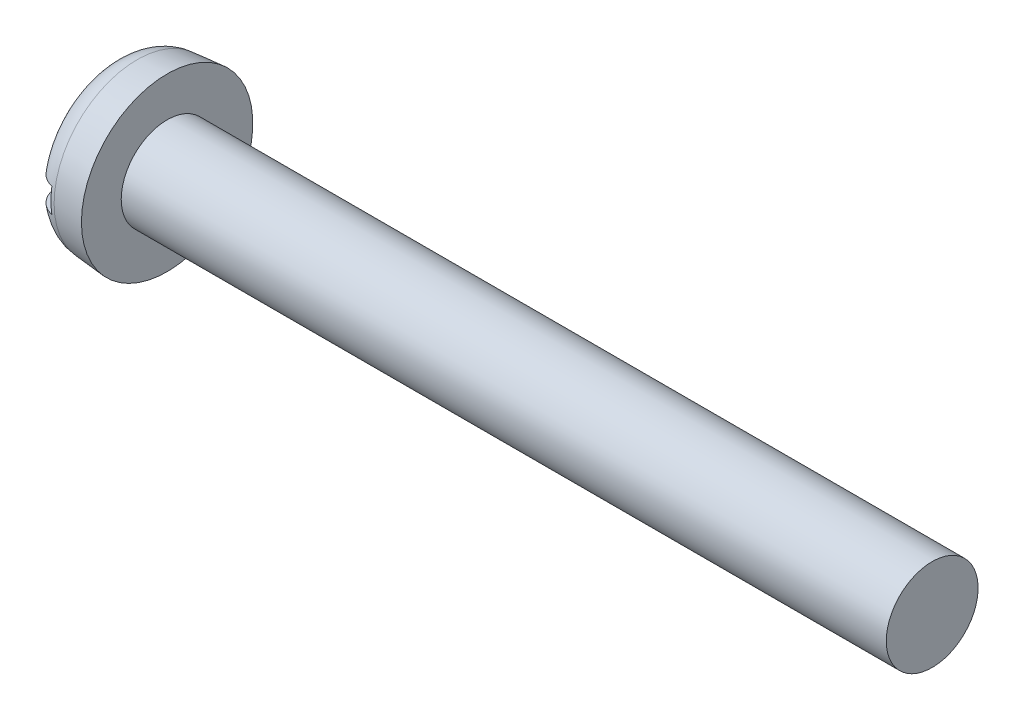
ISO-10303-21;
HEADER;
FILE_DESCRIPTION(('STEP AP214'),'2;1');
FILE_NAME('part.step','',(''),(''),'','','');
FILE_SCHEMA(('AUTOMOTIVE_DESIGN { 1 0 10303 214 1 1 1 1 }'));
ENDSEC;
DATA;
#1=APPLICATION_CONTEXT('core data for automotive mechanical design processes');
#2=APPLICATION_PROTOCOL_DEFINITION('international standard','automotive_design',2000,#1);
#3=PRODUCT_CONTEXT('',#1,'mechanical');
#4=PRODUCT('Part','Part','',(#3));
#5=PRODUCT_RELATED_PRODUCT_CATEGORY('part','',(#4));
#6=PRODUCT_DEFINITION_FORMATION('','',#4);
#7=PRODUCT_DEFINITION_CONTEXT('part definition',#1,'design');
#8=PRODUCT_DEFINITION('design','',#6,#7);
#9=PRODUCT_DEFINITION_SHAPE('','',#8);
#10=(LENGTH_UNIT() NAMED_UNIT(*) SI_UNIT(.MILLI.,.METRE.));
#11=(NAMED_UNIT(*) PLANE_ANGLE_UNIT() SI_UNIT($,.RADIAN.));
#12=(NAMED_UNIT(*) SI_UNIT($,.STERADIAN.) SOLID_ANGLE_UNIT());
#13=UNCERTAINTY_MEASURE_WITH_UNIT(LENGTH_MEASURE(1.E-05),#10,'distance_accuracy_value','');
#14=(GEOMETRIC_REPRESENTATION_CONTEXT(3) GLOBAL_UNCERTAINTY_ASSIGNED_CONTEXT((#13)) GLOBAL_UNIT_ASSIGNED_CONTEXT((#10,
#11,#12)) REPRESENTATION_CONTEXT('',''));
#15=CARTESIAN_POINT('',(0.,0.,0.));
#16=DIRECTION('',(0.,0.,1.));
#17=DIRECTION('',(1.,0.,0.));
#18=AXIS2_PLACEMENT_3D('',#15,#16,#17);
#19=CARTESIAN_POINT('',(0.,0.,0.));
#20=DIRECTION('',(-1.,0.,0.));
#21=DIRECTION('',(0.,0.,1.));
#22=AXIS2_PLACEMENT_3D('',#19,#20,#21);
#23=PLANE('',#22);
#24=DIRECTION('',(0.,0.,-1.));
#25=VECTOR('',#24,1.);
#26=CARTESIAN_POINT('',(0.,0.399999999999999,2.8));
#27=LINE('',#26,#25);
#28=CARTESIAN_POINT('',(0.,0.399999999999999,1.77326763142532));
#29=VERTEX_POINT('',#28);
#30=CARTESIAN_POINT('',(0.,0.399999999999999,-1.77326763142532));
#31=VERTEX_POINT('',#30);
#32=EDGE_CURVE('E89',#29,#31,#27,.T.);
#33=ORIENTED_EDGE('',*,*,#32,.F.);
#34=CARTESIAN_POINT('',(0.,0.,0.));
#35=DIRECTION('',(-1.,0.,0.));
#36=DIRECTION('',(0.,0.,1.));
#37=AXIS2_PLACEMENT_3D('',#34,#35,#36);
#38=CIRCLE('',#37,1.81782234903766);
#39=EDGE_CURVE('E95',#29,#31,#38,.T.);
#40=ORIENTED_EDGE('',*,*,#39,.T.);
#41=EDGE_LOOP('',(#33,#40));
#42=FACE_BOUND('',#41,.T.);
#43=ADVANCED_FACE('F36',(#42),#23,.T.);
#44=CARTESIAN_POINT('',(-25.4,0.,0.));
#45=DIRECTION('',(-1.,0.,0.));
#46=DIRECTION('',(0.,0.,1.));
#47=AXIS2_PLACEMENT_3D('',#44,#45,#46);
#48=CYLINDRICAL_SURFACE('',#47,1.5);
#49=CARTESIAN_POINT('',(26.8,0.,0.));
#50=DIRECTION('',(-1.,0.,0.));
#51=DIRECTION('',(0.,0.,1.));
#52=AXIS2_PLACEMENT_3D('',#49,#50,#51);
#53=CIRCLE('',#52,1.5);
#54=CARTESIAN_POINT('',(26.8,0.,1.5));
#55=VERTEX_POINT('',#54);
#56=EDGE_CURVE('E96',#55,#55,#53,.T.);
#57=ORIENTED_EDGE('',*,*,#56,.T.);
#58=EDGE_LOOP('',(#57));
#59=FACE_BOUND('',#58,.T.);
#60=CARTESIAN_POINT('',(1.8,0.,0.));
#61=DIRECTION('',(-1.,0.,0.));
#62=DIRECTION('',(0.,0.,1.));
#63=AXIS2_PLACEMENT_3D('',#60,#61,#62);
#64=CIRCLE('',#63,1.5);
#65=CARTESIAN_POINT('',(1.8,0.,1.5));
#66=VERTEX_POINT('',#65);
#67=EDGE_CURVE('E153',#66,#66,#64,.T.);
#68=ORIENTED_EDGE('',*,*,#67,.F.);
#69=EDGE_LOOP('',(#68));
#70=FACE_BOUND('',#69,.T.);
#71=ADVANCED_FACE('F141',(#59,#70),#48,.T.);
#72=CARTESIAN_POINT('',(26.8,1.5,0.));
#73=DIRECTION('',(1.,0.,0.));
#74=DIRECTION('',(0.,0.,-1.));
#75=AXIS2_PLACEMENT_3D('',#72,#73,#74);
#76=PLANE('',#75);
#77=ORIENTED_EDGE('',*,*,#56,.F.);
#78=EDGE_LOOP('',(#77));
#79=FACE_BOUND('',#78,.T.);
#80=ADVANCED_FACE('F139',(#79),#76,.T.);
#81=DIRECTION('',(0.,0.,1.));
#82=VECTOR('',#81,1.);
#83=CARTESIAN_POINT('',(0.,-0.4,-2.8));
#84=LINE('',#83,#82);
#85=CARTESIAN_POINT('',(0.,-0.4,-1.77326763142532));
#86=VERTEX_POINT('',#85);
#87=CARTESIAN_POINT('',(0.,-0.4,1.77326763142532));
#88=VERTEX_POINT('',#87);
#89=EDGE_CURVE('E80',#86,#88,#84,.T.);
#90=ORIENTED_EDGE('',*,*,#89,.F.);
#91=EDGE_CURVE('E87',#86,#88,#38,.T.);
#92=ORIENTED_EDGE('',*,*,#91,.T.);
#93=EDGE_LOOP('',(#90,#92));
#94=FACE_BOUND('',#93,.T.);
#95=ADVANCED_FACE('F86',(#94),#23,.T.);
#96=CARTESIAN_POINT('',(0.,0.,0.));
#97=DIRECTION('',(1.,0.,0.));
#98=DIRECTION('',(0.,0.,-1.));
#99=AXIS2_PLACEMENT_3D('',#96,#97,#98);
#100=CONICAL_SURFACE('',#99,2.64252040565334,0.087266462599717);
#101=CARTESIAN_POINT('',(0.821559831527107,0.,0.));
#102=DIRECTION('',(-1.,0.,0.));
#103=DIRECTION('',(0.,0.,1.));
#104=AXIS2_PLACEMENT_3D('',#101,#102,#103);
#105=CIRCLE('',#104,2.71439757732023);
#106=CARTESIAN_POINT('',(0.821559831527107,0.,2.71439757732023));
#107=VERTEX_POINT('',#106);
#108=EDGE_CURVE('E99',#107,#107,#105,.F.);
#109=ORIENTED_EDGE('',*,*,#108,.T.);
#110=EDGE_LOOP('',(#109));
#111=FACE_BOUND('',#110,.T.);
#112=CARTESIAN_POINT('',(1.8,0.,0.));
#113=DIRECTION('',(-1.,0.,0.));
#114=DIRECTION('',(0.,0.,1.));
#115=AXIS2_PLACEMENT_3D('',#112,#113,#114);
#116=CIRCLE('',#115,2.8);
#117=CARTESIAN_POINT('',(1.8,0.,2.8));
#118=VERTEX_POINT('',#117);
#119=EDGE_CURVE('E101',#118,#118,#116,.T.);
#120=ORIENTED_EDGE('',*,*,#119,.T.);
#121=EDGE_LOOP('',(#120));
#122=FACE_BOUND('',#121,.T.);
#123=ADVANCED_FACE('F132',(#111,#122),#100,.T.);
#124=CARTESIAN_POINT('',(1.8,1.5,0.));
#125=DIRECTION('',(-1.,0.,0.));
#126=DIRECTION('',(0.,0.,1.));
#127=AXIS2_PLACEMENT_3D('',#124,#125,#126);
#128=PLANE('',#127);
#129=ORIENTED_EDGE('',*,*,#119,.F.);
#130=EDGE_LOOP('',(#129));
#131=FACE_BOUND('',#130,.T.);
#132=ORIENTED_EDGE('',*,*,#67,.T.);
#133=EDGE_LOOP('',(#132));
#134=FACE_BOUND('',#133,.T.);
#135=ADVANCED_FACE('F128',(#131,#134),#128,.F.);
#136=CARTESIAN_POINT('',(0.9,0.,0.));
#137=DIRECTION('',(-1.,0.,0.));
#138=DIRECTION('',(0.,0.,1.));
#139=AXIS2_PLACEMENT_3D('',#136,#137,#138);
#140=TOROIDAL_SURFACE('',#139,1.81782234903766,0.9);
#141=CARTESIAN_POINT('',(0.285780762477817,0.399999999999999,-2.44311963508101));
#142=CARTESIAN_POINT('',(0.322325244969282,0.399999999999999,-2.47769297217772));
#143=CARTESIAN_POINT('',(0.361794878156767,0.399999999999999,-2.50922544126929));
#144=CARTESIAN_POINT('',(0.445493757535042,0.399999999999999,-2.56525291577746));
#145=CARTESIAN_POINT('',(0.48972822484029,0.399999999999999,-2.58974009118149));
#146=CARTESIAN_POINT('',(0.581685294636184,0.399999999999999,-2.63091846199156));
#147=CARTESIAN_POINT('',(0.629407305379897,0.399999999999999,-2.64761097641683));
#148=CARTESIAN_POINT('',(0.726972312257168,0.399999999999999,-2.67270033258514));
#149=CARTESIAN_POINT('',(0.776814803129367,0.399999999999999,-2.68109913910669));
#150=CARTESIAN_POINT('',(0.876977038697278,0.399999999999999,-2.68933922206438));
#151=CARTESIAN_POINT('',(0.92729364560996,0.399999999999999,-2.68921866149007));
#152=CARTESIAN_POINT('',(1.02719093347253,0.399999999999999,-2.68051830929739));
#153=CARTESIAN_POINT('',(1.07677160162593,0.399999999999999,-2.67193837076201));
#154=CARTESIAN_POINT('',(1.17371760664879,0.399999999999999,-2.6465919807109));
#155=CARTESIAN_POINT('',(1.2210859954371,0.399999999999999,-2.62983719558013));
#156=CARTESIAN_POINT('',(1.31235127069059,0.399999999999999,-2.58864040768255));
#157=CARTESIAN_POINT('',(1.35624813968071,0.399999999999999,-2.56419836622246));
#158=CARTESIAN_POINT('',(1.43950339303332,0.399999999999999,-2.50824069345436));
#159=CARTESIAN_POINT('',(1.47884484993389,0.399999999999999,-2.47669988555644));
#160=CARTESIAN_POINT('',(1.55173067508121,0.399999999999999,-2.40751412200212));
#161=CARTESIAN_POINT('',(1.5852748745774,0.399999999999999,-2.36986898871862));
#162=CARTESIAN_POINT('',(1.64594872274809,0.399999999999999,-2.28919528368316));
#163=CARTESIAN_POINT('',(1.67301846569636,0.399999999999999,-2.24612167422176));
#164=CARTESIAN_POINT('',(1.71966197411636,0.399999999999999,-2.15609376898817));
#165=CARTESIAN_POINT('',(1.73923530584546,0.399999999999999,-2.10913924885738));
#166=CARTESIAN_POINT('',(1.77066025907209,0.399999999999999,-2.01194193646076));
#167=CARTESIAN_POINT('',(1.78239254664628,0.399999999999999,-1.96166058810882));
#168=CARTESIAN_POINT('',(1.7974373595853,0.399999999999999,-1.85985639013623));
#169=CARTESIAN_POINT('',(1.80074908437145,0.399999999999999,-1.80833342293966));
#170=CARTESIAN_POINT('',(1.79894832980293,0.399999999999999,-1.70434405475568));
#171=CARTESIAN_POINT('',(1.79365584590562,0.399999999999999,-1.651880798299));
#172=CARTESIAN_POINT('',(1.77456092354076,0.399999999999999,-1.54852841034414));
#173=CARTESIAN_POINT('',(1.76075741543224,0.399999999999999,-1.49763947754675));
#174=CARTESIAN_POINT('',(1.7246504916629,0.399999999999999,-1.3975266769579));
#175=CARTESIAN_POINT('',(1.70214283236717,0.399999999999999,-1.34837644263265));
#176=CARTESIAN_POINT('',(1.64933120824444,0.399999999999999,-1.25444995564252));
#177=CARTESIAN_POINT('',(1.6190255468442,0.399999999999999,-1.20967465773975));
#178=CARTESIAN_POINT('',(1.55085214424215,0.399999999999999,-1.12504927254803));
#179=CARTESIAN_POINT('',(1.51286662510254,0.399999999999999,-1.08529386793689));
#180=CARTESIAN_POINT('',(1.4306134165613,0.399999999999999,-1.01288372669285));
#181=CARTESIAN_POINT('',(1.38634513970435,0.399999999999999,-0.980229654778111));
#182=CARTESIAN_POINT('',(1.29378824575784,0.399999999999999,-0.924048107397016));
#183=CARTESIAN_POINT('',(1.24562231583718,0.399999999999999,-0.900319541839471));
#184=CARTESIAN_POINT('',(1.14574424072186,0.399999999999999,-0.862177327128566));
#185=CARTESIAN_POINT('',(1.09403573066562,0.399999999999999,-0.847754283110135));
#186=CARTESIAN_POINT('',(0.993395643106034,0.399999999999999,-0.830011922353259));
#187=CARTESIAN_POINT('',(0.944615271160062,0.399999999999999,-0.825833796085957));
#188=CARTESIAN_POINT('',(0.847107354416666,0.399999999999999,-0.826334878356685));
#189=CARTESIAN_POINT('',(0.798379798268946,0.399999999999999,-0.831011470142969));
#190=CARTESIAN_POINT('',(0.705495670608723,0.399999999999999,-0.848340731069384));
#191=CARTESIAN_POINT('',(0.661242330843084,0.399999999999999,-0.860484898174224));
#192=CARTESIAN_POINT('',(0.575232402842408,0.399999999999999,-0.891650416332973));
#193=CARTESIAN_POINT('',(0.53347652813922,0.399999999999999,-0.910673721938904));
#194=CARTESIAN_POINT('',(0.451191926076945,0.399999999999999,-0.956010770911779));
#195=CARTESIAN_POINT('',(0.410848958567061,0.399999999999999,-0.982660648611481));
#196=CARTESIAN_POINT('',(0.334722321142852,0.399999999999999,-1.04182188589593));
#197=CARTESIAN_POINT('',(0.298940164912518,0.399999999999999,-1.0743351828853));
#198=CARTESIAN_POINT('',(0.229649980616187,0.399999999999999,-1.14749226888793));
#199=CARTESIAN_POINT('',(0.19663491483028,0.399999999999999,-1.18860403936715));
#200=CARTESIAN_POINT('',(0.137645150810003,0.399999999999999,-1.27560624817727));
#201=CARTESIAN_POINT('',(0.111672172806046,0.399999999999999,-1.32149785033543));
#202=CARTESIAN_POINT('',(0.0665593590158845,0.399999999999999,-1.41881690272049));
#203=CARTESIAN_POINT('',(0.0477401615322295,0.399999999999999,-1.47039354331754));
#204=CARTESIAN_POINT('',(0.0191028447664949,0.399999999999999,-1.57598967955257));
#205=CARTESIAN_POINT('',(0.0092842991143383,0.399999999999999,-1.63000905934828));
#206=CARTESIAN_POINT('',(-0.000908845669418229,0.399999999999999,-1.73850050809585));
#207=CARTESIAN_POINT('',(-0.00135843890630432,0.399999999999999,-1.7929654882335));
#208=CARTESIAN_POINT('',(0.00713794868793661,0.399999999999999,-1.90117587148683));
#209=CARTESIAN_POINT('',(0.0160852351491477,0.399999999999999,-1.9549211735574));
#210=CARTESIAN_POINT('',(0.0428869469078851,0.399999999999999,-2.05874477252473));
#211=CARTESIAN_POINT('',(0.0605196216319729,0.399999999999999,-2.10888044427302));
#212=CARTESIAN_POINT('',(0.104140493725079,0.399999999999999,-2.20532358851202));
#213=CARTESIAN_POINT('',(0.130117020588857,0.399999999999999,-2.25163629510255));
#214=CARTESIAN_POINT('',(0.178150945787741,0.399999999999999,-2.32211375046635));
#215=CARTESIAN_POINT('',(0.197843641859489,0.399999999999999,-2.34792122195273));
#216=CARTESIAN_POINT('',(0.239879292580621,0.399999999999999,-2.39728022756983));
#217=CARTESIAN_POINT('',(0.26222221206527,0.399999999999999,-2.42083179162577));
#218=CARTESIAN_POINT('',(0.285780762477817,0.399999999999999,-2.44311963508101));
#219=B_SPLINE_CURVE_WITH_KNOTS('',3,(#141,#142,#143,#144,#145,#146,#147,#148,#149,#150,#151,
#152,#153,#154,#155,#156,#157,#158,#159,#160,#161,#162,#163,#164,#165,#166,#167,#168,#169,#170,
#171,#172,#173,#174,#175,#176,#177,#178,#179,#180,#181,#182,#183,#184,#185,#186,#187,#188,#189,
#190,#191,#192,#193,#194,#195,#196,#197,#198,#199,#200,#201,#202,#203,#204,#205,#206,#207,#208,
#209,#210,#211,#212,#213,#214,#215,#216,#217,#218),.UNSPECIFIED.,.T.,.F.,(4,2,2,2,2,2,2,2,2,2,2,
2,2,2,2,2,2,2,2,2,2,2,2,2,2,2,2,2,2,2,2,2,2,2,2,2,2,2,4),(0.,0.15080428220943,0.301775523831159,
0.452721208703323,0.603631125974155,0.753865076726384,0.904101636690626,1.05412441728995,
1.2041479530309,1.35471219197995,1.50528081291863,1.65719291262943,1.80911380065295,
1.96329712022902,2.11749509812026,2.27496068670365,2.43244606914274,2.59387611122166,
2.75534130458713,2.9195015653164,3.08367718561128,3.24389389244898,3.40394859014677,
3.55004213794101,3.69609251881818,3.83315592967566,3.97025831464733,4.11470991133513,
4.25920932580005,4.41668805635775,4.57420522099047,4.73812462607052,4.90203626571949,
5.06463536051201,5.22725705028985,5.38592661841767,5.54437521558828,5.64159310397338,
5.73880970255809),.UNSPECIFIED.);
#220=CARTESIAN_POINT('',(0.7,0.399999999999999,-2.66547244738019));
#221=VERTEX_POINT('',#220);
#222=EDGE_CURVE('E11',#31,#221,#219,.T.);
#223=ORIENTED_EDGE('',*,*,#222,.F.);
#224=ORIENTED_EDGE('',*,*,#39,.F.);
#225=CARTESIAN_POINT('',(0.356169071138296,0.399999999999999,1.02545886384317));
#226=CARTESIAN_POINT('',(0.394477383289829,0.399999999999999,0.994276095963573));
#227=CARTESIAN_POINT('',(0.435252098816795,0.399999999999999,0.966090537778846));
#228=CARTESIAN_POINT('',(0.520874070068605,0.399999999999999,0.916713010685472));
#229=CARTESIAN_POINT('',(0.56572297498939,0.399999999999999,0.895523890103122));
#230=CARTESIAN_POINT('',(0.658585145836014,0.399999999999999,0.861072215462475));
#231=CARTESIAN_POINT('',(0.706609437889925,0.399999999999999,0.84783908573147));
#232=CARTESIAN_POINT('',(0.80424325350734,0.399999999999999,0.83024223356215));
#233=CARTESIAN_POINT('',(0.853851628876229,0.399999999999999,0.825872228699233));
#234=CARTESIAN_POINT('',(0.950010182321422,0.399999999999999,0.826277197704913));
#235=CARTESIAN_POINT('',(0.99656347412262,0.399999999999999,0.830513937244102));
#236=CARTESIAN_POINT('',(1.08828168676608,0.399999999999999,0.846797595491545));
#237=CARTESIAN_POINT('',(1.1334463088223,0.399999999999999,0.858846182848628));
#238=CARTESIAN_POINT('',(1.22099947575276,0.399999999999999,0.890027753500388));
#239=CARTESIAN_POINT('',(1.26339999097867,0.399999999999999,0.909127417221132));
#240=CARTESIAN_POINT('',(1.34475562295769,0.399999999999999,0.953613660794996));
#241=CARTESIAN_POINT('',(1.38370973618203,0.399999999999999,0.979002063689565));
#242=CARTESIAN_POINT('',(1.4606297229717,0.399999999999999,1.03768873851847));
#243=CARTESIAN_POINT('',(1.49821861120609,0.399999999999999,1.07148126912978));
#244=CARTESIAN_POINT('',(1.56766557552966,0.399999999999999,1.14451739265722));
#245=CARTESIAN_POINT('',(1.59952174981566,0.399999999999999,1.18376278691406));
#246=CARTESIAN_POINT('',(1.65882951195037,0.399999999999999,1.26965174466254));
#247=CARTESIAN_POINT('',(1.68580874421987,0.399999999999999,1.3166225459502));
#248=CARTESIAN_POINT('',(1.7316261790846,0.399999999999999,1.41438438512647));
#249=CARTESIAN_POINT('',(1.7504634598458,0.399999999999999,1.46517585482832));
#250=CARTESIAN_POINT('',(1.77959171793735,0.399999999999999,1.56990546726));
#251=CARTESIAN_POINT('',(1.78976336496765,0.399999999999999,1.62387693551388));
#252=CARTESIAN_POINT('',(1.80070617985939,0.399999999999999,1.73276786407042));
#253=CARTESIAN_POINT('',(1.80147810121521,0.399999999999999,1.78768724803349));
#254=CARTESIAN_POINT('',(1.7935515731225,0.399999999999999,1.89576039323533));
#255=CARTESIAN_POINT('',(1.78503812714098,0.399999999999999,1.94892767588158));
#256=CARTESIAN_POINT('',(1.75897009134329,0.399999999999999,2.05299963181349));
#257=CARTESIAN_POINT('',(1.74141670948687,0.399999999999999,2.10390460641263));
#258=CARTESIAN_POINT('',(1.69825810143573,0.399999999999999,2.20064023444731));
#259=CARTESIAN_POINT('',(1.67286703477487,0.399999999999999,2.24656646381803));
#260=CARTESIAN_POINT('',(1.61458416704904,0.399999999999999,2.33338474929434));
#261=CARTESIAN_POINT('',(1.58169323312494,0.399999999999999,2.37427738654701));
#262=CARTESIAN_POINT('',(1.51007060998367,0.399999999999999,2.44900649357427));
#263=CARTESIAN_POINT('',(1.47146964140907,0.399999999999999,2.48296829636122));
#264=CARTESIAN_POINT('',(1.38904817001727,0.399999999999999,2.54382334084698));
#265=CARTESIAN_POINT('',(1.34522808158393,0.399999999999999,2.57071714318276));
#266=CARTESIAN_POINT('',(1.25424836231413,0.399999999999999,2.61630908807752));
#267=CARTESIAN_POINT('',(1.20714119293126,0.399999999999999,2.63511196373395));
#268=CARTESIAN_POINT('',(1.11042474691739,0.399999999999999,2.66447616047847));
#269=CARTESIAN_POINT('',(1.06081558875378,0.399999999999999,2.67503787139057));
#270=CARTESIAN_POINT('',(0.960893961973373,0.399999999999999,2.68755622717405));
#271=CARTESIAN_POINT('',(0.910589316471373,0.399999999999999,2.68957539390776));
#272=CARTESIAN_POINT('',(0.810358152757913,0.399999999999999,2.68512046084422));
#273=CARTESIAN_POINT('',(0.760431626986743,0.399999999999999,2.67864653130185));
#274=CARTESIAN_POINT('',(0.662478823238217,0.399999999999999,2.65741995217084));
#275=CARTESIAN_POINT('',(0.614448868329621,0.399999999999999,2.64268425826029));
#276=CARTESIAN_POINT('',(0.521534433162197,0.399999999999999,2.60538142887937));
#277=CARTESIAN_POINT('',(0.476649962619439,0.399999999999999,2.58281426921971));
#278=CARTESIAN_POINT('',(0.391148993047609,0.399999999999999,2.53043182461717));
#279=CARTESIAN_POINT('',(0.350545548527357,0.399999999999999,2.50059523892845));
#280=CARTESIAN_POINT('',(0.274874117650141,0.399999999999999,2.43457977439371));
#281=CARTESIAN_POINT('',(0.239806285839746,0.399999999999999,2.39840071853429));
#282=CARTESIAN_POINT('',(0.1758792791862,0.399999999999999,2.32042102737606));
#283=CARTESIAN_POINT('',(0.147073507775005,0.399999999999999,2.27857662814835));
#284=CARTESIAN_POINT('',(0.0967847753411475,0.399999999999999,2.19069995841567));
#285=CARTESIAN_POINT('',(0.07530224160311,0.399999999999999,2.14466744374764));
#286=CARTESIAN_POINT('',(0.0399276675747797,0.399999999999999,2.04903409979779));
#287=CARTESIAN_POINT('',(0.0261471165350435,0.399999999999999,1.99939205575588));
#288=CARTESIAN_POINT('',(0.00693602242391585,0.399999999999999,1.89852251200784));
#289=CARTESIAN_POINT('',(0.00150590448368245,0.399999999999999,1.84729493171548));
#290=CARTESIAN_POINT('',(-0.000985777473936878,0.399999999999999,1.74359522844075));
#291=CARTESIAN_POINT('',(0.0021251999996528,0.399999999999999,1.69111899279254));
#292=CARTESIAN_POINT('',(0.0168916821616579,0.399999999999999,1.58737297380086));
#293=CARTESIAN_POINT('',(0.0285499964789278,0.399999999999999,1.53610359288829));
#294=CARTESIAN_POINT('',(0.0604020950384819,0.399999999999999,1.43486374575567));
#295=CARTESIAN_POINT('',(0.080804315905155,0.399999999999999,1.38495893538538));
#296=CARTESIAN_POINT('',(0.129530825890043,0.399999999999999,1.28921347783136));
#297=CARTESIAN_POINT('',(0.157849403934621,0.399999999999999,1.24336993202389));
#298=CARTESIAN_POINT('',(0.213684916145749,0.399999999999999,1.16773658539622));
#299=CARTESIAN_POINT('',(0.239651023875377,0.399999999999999,1.13678903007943));
#300=CARTESIAN_POINT('',(0.29525297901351,0.399999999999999,1.07838116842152));
#301=CARTESIAN_POINT('',(0.324888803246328,0.399999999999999,1.05092084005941));
#302=CARTESIAN_POINT('',(0.356169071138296,0.399999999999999,1.02545886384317));
#303=B_SPLINE_CURVE_WITH_KNOTS('',3,(#225,#226,#227,#228,#229,#230,#231,#232,#233,#234,#235,
#236,#237,#238,#239,#240,#241,#242,#243,#244,#245,#246,#247,#248,#249,#250,#251,#252,#253,#254,
#255,#256,#257,#258,#259,#260,#261,#262,#263,#264,#265,#266,#267,#268,#269,#270,#271,#272,#273,
#274,#275,#276,#277,#278,#279,#280,#281,#282,#283,#284,#285,#286,#287,#288,#289,#290,#291,#292,
#293,#294,#295,#296,#297,#298,#299,#300,#301,#302),.UNSPECIFIED.,.T.,.F.,(4,2,2,2,2,2,2,2,2,2,2,
2,2,2,2,2,2,2,2,2,2,2,2,2,2,2,2,2,2,2,2,2,2,2,2,2,2,2,4),(0.,0.148056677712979,
0.296173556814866,0.444834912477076,0.593390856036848,0.732942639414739,0.87252424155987,
1.01145452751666,1.15042513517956,1.30141738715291,1.45245963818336,1.61420969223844,
1.7759780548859,1.93993961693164,2.10388803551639,2.26462860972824,2.42534771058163,
2.58201478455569,2.73866375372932,2.89216335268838,3.04565077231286,3.19708679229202,
3.34851564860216,3.49883427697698,3.64914989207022,3.79915813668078,3.94916684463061,
4.09962050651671,4.25007836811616,4.40177296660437,4.55347641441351,4.70732244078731,
4.86117629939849,5.0181609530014,5.17519723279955,5.33620557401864,5.49709805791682,
5.61799301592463,5.73888721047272),.UNSPECIFIED.);
#304=CARTESIAN_POINT('',(0.7,0.399999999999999,2.66547244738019));
#305=VERTEX_POINT('',#304);
#306=EDGE_CURVE('E113',#305,#29,#303,.T.);
#307=ORIENTED_EDGE('',*,*,#306,.F.);
#308=CARTESIAN_POINT('',(0.7,0.,0.));
#309=DIRECTION('',(-1.,0.,0.));
#310=DIRECTION('',(0.,0.,1.));
#311=AXIS2_PLACEMENT_3D('',#308,#309,#310);
#312=CIRCLE('',#311,2.69531878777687);
#313=CARTESIAN_POINT('',(0.7,-0.4,2.66547244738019));
#314=VERTEX_POINT('',#313);
#315=EDGE_CURVE('E107',#305,#314,#312,.F.);
#316=ORIENTED_EDGE('',*,*,#315,.T.);
#317=CARTESIAN_POINT('',(0.356169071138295,-0.4,1.02545886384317));
#318=CARTESIAN_POINT('',(0.314031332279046,-0.4,1.05976167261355));
#319=CARTESIAN_POINT('',(0.274819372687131,-0.4,1.0977427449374));
#320=CARTESIAN_POINT('',(0.20326819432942,-0.4,1.17978565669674));
#321=CARTESIAN_POINT('',(0.170942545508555,-0.4,1.22385922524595));
#322=CARTESIAN_POINT('',(0.114111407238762,-0.4,1.31672727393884));
#323=CARTESIAN_POINT('',(0.0895968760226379,-0.4,1.36551620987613));
#324=CARTESIAN_POINT('',(0.0490785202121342,-0.4,1.46648183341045));
#325=CARTESIAN_POINT('',(0.0330703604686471,-0.4,1.51865678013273));
#326=CARTESIAN_POINT('',(0.0100453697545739,-0.4,1.62518908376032));
#327=CARTESIAN_POINT('',(0.00306618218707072,-0.4,1.67955460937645));
#328=CARTESIAN_POINT('',(-0.00144685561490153,-0.4,1.78868546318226));
#329=CARTESIAN_POINT('',(0.00101939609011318,-0.4,1.84345079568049));
#330=CARTESIAN_POINT('',(0.0152891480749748,-0.4,1.95052330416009));
#331=CARTESIAN_POINT('',(0.0268854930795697,-0.4,2.0028580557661));
#332=CARTESIAN_POINT('',(0.0589248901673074,-0.4,2.10474672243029));
#333=CARTESIAN_POINT('',(0.0793666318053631,-0.4,2.15430104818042));
#334=CARTESIAN_POINT('',(0.12795627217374,-0.4,2.24792186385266));
#335=CARTESIAN_POINT('',(0.155901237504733,-0.4,2.29209371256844));
#336=CARTESIAN_POINT('',(0.218944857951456,-0.4,2.37499861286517));
#337=CARTESIAN_POINT('',(0.254042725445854,-0.4,2.41373226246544));
#338=CARTESIAN_POINT('',(0.32966685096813,-0.4,2.48389534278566));
#339=CARTESIAN_POINT('',(0.370077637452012,-0.4,2.51544927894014));
#340=CARTESIAN_POINT('',(0.455677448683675,-0.4,2.57122459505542));
#341=CARTESIAN_POINT('',(0.500866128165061,-0.4,2.59544650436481));
#342=CARTESIAN_POINT('',(0.59413782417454,-0.4,2.6355729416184));
#343=CARTESIAN_POINT('',(0.642178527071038,-0.4,2.65157587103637));
#344=CARTESIAN_POINT('',(0.740273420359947,-0.4,2.67523109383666));
#345=CARTESIAN_POINT('',(0.790327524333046,-0.4,2.68288374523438));
#346=CARTESIAN_POINT('',(0.890686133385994,-0.4,2.68958762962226));
#347=CARTESIAN_POINT('',(0.940986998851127,-0.4,2.68869347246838));
#348=CARTESIAN_POINT('',(1.04072178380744,-0.4,2.67846167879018));
#349=CARTESIAN_POINT('',(1.0901557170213,-0.4,2.66912417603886));
#350=CARTESIAN_POINT('',(1.18669599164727,-0.4,2.64229877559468));
#351=CARTESIAN_POINT('',(1.23380501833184,-0.4,2.6248205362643));
#352=CARTESIAN_POINT('',(1.32443528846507,-0.4,2.58223220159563));
#353=CARTESIAN_POINT('',(1.36795650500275,-0.4,2.5571220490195));
#354=CARTESIAN_POINT('',(1.45036421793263,-0.4,2.49989362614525));
#355=CARTESIAN_POINT('',(1.48923230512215,-0.4,2.46774885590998));
#356=CARTESIAN_POINT('',(1.56107927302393,-0.4,2.39744378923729));
#357=CARTESIAN_POINT('',(1.59405796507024,-0.4,2.35928330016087));
#358=CARTESIAN_POINT('',(1.65352847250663,-0.4,2.2776666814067));
#359=CARTESIAN_POINT('',(1.67995797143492,-0.4,2.23416516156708));
#360=CARTESIAN_POINT('',(1.72526137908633,-0.4,2.14339421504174));
#361=CARTESIAN_POINT('',(1.74413484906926,-0.4,2.09612456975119));
#362=CARTESIAN_POINT('',(1.77411508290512,-0.4,1.9983989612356));
#363=CARTESIAN_POINT('',(1.78509960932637,-0.4,1.9479055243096));
#364=CARTESIAN_POINT('',(1.79862667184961,-0.4,1.84580292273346));
#365=CARTESIAN_POINT('',(1.80116838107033,-0.4,1.79419364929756));
#366=CARTESIAN_POINT('',(1.79780993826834,-0.4,1.69014314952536));
#367=CARTESIAN_POINT('',(1.79172746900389,-0.4,1.63770783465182));
#368=CARTESIAN_POINT('',(1.77106806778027,-0.4,1.53454005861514));
#369=CARTESIAN_POINT('',(1.75649007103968,-0.4,1.48380781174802));
#370=CARTESIAN_POINT('',(1.7188487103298,-0.4,1.38413781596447));
#371=CARTESIAN_POINT('',(1.69558194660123,-0.4,1.33527684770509));
#372=CARTESIAN_POINT('',(1.64130257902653,-0.4,1.24205401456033));
#373=CARTESIAN_POINT('',(1.6102882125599,-0.4,1.19769317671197));
#374=CARTESIAN_POINT('',(1.54078360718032,-0.4,1.11407031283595));
#375=CARTESIAN_POINT('',(1.50218355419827,-0.4,1.07489936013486));
#376=CARTESIAN_POINT('',(1.418793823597,-0.4,1.00377929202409));
#377=CARTESIAN_POINT('',(1.37400377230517,-0.4,0.971830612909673));
#378=CARTESIAN_POINT('',(1.28066227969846,-0.4,0.917245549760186));
#379=CARTESIAN_POINT('',(1.23224470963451,-0.4,0.894381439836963));
#380=CARTESIAN_POINT('',(1.13202516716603,-0.4,0.858023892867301));
#381=CARTESIAN_POINT('',(1.08022692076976,-0.4,0.844520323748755));
#382=CARTESIAN_POINT('',(0.979686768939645,-0.4,0.828554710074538));
#383=CARTESIAN_POINT('',(0.93108358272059,-0.4,0.82521631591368));
#384=CARTESIAN_POINT('',(0.834057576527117,-0.4,0.827306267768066));
#385=CARTESIAN_POINT('',(0.785634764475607,-0.4,0.832734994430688));
#386=CARTESIAN_POINT('',(0.693219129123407,-0.4,0.851440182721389));
#387=CARTESIAN_POINT('',(0.6491307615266,-0.4,0.864254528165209));
#388=CARTESIAN_POINT('',(0.563580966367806,-0.4,0.896690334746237));
#389=CARTESIAN_POINT('',(0.522117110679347,-0.4,0.916305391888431));
#390=CARTESIAN_POINT('',(0.460201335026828,-0.4,0.951554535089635));
#391=CARTESIAN_POINT('',(0.438547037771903,-0.4,0.965129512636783));
#392=CARTESIAN_POINT('',(0.396436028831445,-0.4,0.994018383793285));
#393=CARTESIAN_POINT('',(0.375979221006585,-0.4,1.00933213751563));
#394=CARTESIAN_POINT('',(0.356169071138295,-0.4,1.02545886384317));
#395=B_SPLINE_CURVE_WITH_KNOTS('',3,(#317,#318,#319,#320,#321,#322,#323,#324,#325,#326,#327,
#328,#329,#330,#331,#332,#333,#334,#335,#336,#337,#338,#339,#340,#341,#342,#343,#344,#345,#346,
#347,#348,#349,#350,#351,#352,#353,#354,#355,#356,#357,#358,#359,#360,#361,#362,#363,#364,#365,
#366,#367,#368,#369,#370,#371,#372,#373,#374,#375,#376,#377,#378,#379,#380,#381,#382,#383,#384,
#385,#386,#387,#388,#389,#390,#391,#392,#393,#394),.UNSPECIFIED.,.T.,.F.,(4,2,2,2,2,2,2,2,2,2,2,
2,2,2,2,2,2,2,2,2,2,2,2,2,2,2,2,2,2,2,2,2,2,2,2,2,2,2,4),(0.,0.162908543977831,
0.326135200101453,0.489172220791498,0.652126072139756,0.815757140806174,0.979389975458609,
1.13941349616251,1.29941331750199,1.45545894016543,1.61148738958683,1.76455910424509,
1.91761976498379,2.068802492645,2.21997873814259,2.37018969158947,2.52039826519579,
2.67042907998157,2.82046101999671,2.97106818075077,3.12168016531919,3.27367450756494,
3.42567767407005,3.5799880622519,3.73431356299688,3.89195060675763,4.04960741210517,
4.2112132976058,4.37285598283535,4.53703863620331,4.70123120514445,4.86099956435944,
5.02059471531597,5.16597452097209,5.31136063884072,5.44850857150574,5.58552770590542,
5.66212180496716,5.73870974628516),.UNSPECIFIED.);
#396=EDGE_CURVE('E94',#88,#314,#395,.T.);
#397=ORIENTED_EDGE('',*,*,#396,.F.);
#398=ORIENTED_EDGE('',*,*,#91,.F.);
#399=CARTESIAN_POINT('',(0.285780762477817,-0.4,-2.44311963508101));
#400=CARTESIAN_POINT('',(0.248557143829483,-0.4,-2.4078972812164));
#401=CARTESIAN_POINT('',(0.214312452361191,-0.4,-2.3694650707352));
#402=CARTESIAN_POINT('',(0.152768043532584,-0.4,-2.28733938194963));
#403=CARTESIAN_POINT('',(0.125478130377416,-0.4,-2.24363860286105));
#404=CARTESIAN_POINT('',(0.0786257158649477,-0.4,-2.15234079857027));
#405=CARTESIAN_POINT('',(0.0590537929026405,-0.4,-2.10474861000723));
#406=CARTESIAN_POINT('',(0.0280650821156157,-0.4,-2.00700047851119));
#407=CARTESIAN_POINT('',(0.0166461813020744,-0.4,-1.95684520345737));
#408=CARTESIAN_POINT('',(0.00206923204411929,-0.4,-1.85464080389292));
#409=CARTESIAN_POINT('',(-0.000972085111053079,-0.4,-1.80257506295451));
#410=CARTESIAN_POINT('',(0.00151453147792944,-0.4,-1.69864852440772));
#411=CARTESIAN_POINT('',(0.00704382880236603,-0.4,-1.64678776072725));
#412=CARTESIAN_POINT('',(0.0266516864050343,-0.4,-1.5434240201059));
#413=CARTESIAN_POINT('',(0.0409314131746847,-0.4,-1.49195921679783));
#414=CARTESIAN_POINT('',(0.0777275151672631,-0.4,-1.39206285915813));
#415=CARTESIAN_POINT('',(0.100245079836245,-0.4,-1.34363174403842));
#416=CARTESIAN_POINT('',(0.153482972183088,-0.4,-1.2500005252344));
#417=CARTESIAN_POINT('',(0.184382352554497,-0.4,-1.20490211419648));
#418=CARTESIAN_POINT('',(0.253306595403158,-0.4,-1.12049761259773));
#419=CARTESIAN_POINT('',(0.29133345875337,-0.4,-1.08119315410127));
#420=CARTESIAN_POINT('',(0.373599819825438,-0.4,-1.00962170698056));
#421=CARTESIAN_POINT('',(0.417845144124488,-0.4,-0.977361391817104));
#422=CARTESIAN_POINT('',(0.511393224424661,-0.4,-0.921257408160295));
#423=CARTESIAN_POINT('',(0.560693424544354,-0.4,-0.897409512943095));
#424=CARTESIAN_POINT('',(0.659899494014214,-0.4,-0.86056620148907));
#425=CARTESIAN_POINT('',(0.709596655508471,-0.4,-0.847011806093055));
#426=CARTESIAN_POINT('',(0.81063175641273,-0.4,-0.829407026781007));
#427=CARTESIAN_POINT('',(0.861968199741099,-0.4,-0.825348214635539));
#428=CARTESIAN_POINT('',(0.959752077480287,-0.4,-0.82693832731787));
#429=CARTESIAN_POINT('',(1.00621575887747,-0.4,-0.831730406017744));
#430=CARTESIAN_POINT('',(1.09766854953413,-0.4,-0.849077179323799));
#431=CARTESIAN_POINT('',(1.14265739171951,-0.4,-0.861633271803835));
#432=CARTESIAN_POINT('',(1.2299114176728,-0.4,-0.893807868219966));
#433=CARTESIAN_POINT('',(1.27218175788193,-0.4,-0.913412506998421));
#434=CARTESIAN_POINT('',(1.35320643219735,-0.4,-0.958874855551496));
#435=CARTESIAN_POINT('',(1.39195973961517,-0.4,-0.984734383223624));
#436=CARTESIAN_POINT('',(1.46843970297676,-0.4,-1.04440221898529));
#437=CARTESIAN_POINT('',(1.5057776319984,-0.4,-1.07870901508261));
#438=CARTESIAN_POINT('',(1.57463408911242,-0.4,-1.15273784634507));
#439=CARTESIAN_POINT('',(1.60615068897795,-0.4,-1.19246166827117));
#440=CARTESIAN_POINT('',(1.66460952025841,-0.4,-1.27921419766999));
#441=CARTESIAN_POINT('',(1.69108592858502,-0.4,-1.32655784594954));
#442=CARTESIAN_POINT('',(1.73582713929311,-0.4,-1.42498260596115));
#443=CARTESIAN_POINT('',(1.75409110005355,-0.4,-1.47606410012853));
#444=CARTESIAN_POINT('',(1.7819800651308,-0.4,-1.58118959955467));
#445=CARTESIAN_POINT('',(1.79150042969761,-0.4,-1.63526148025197));
#446=CARTESIAN_POINT('',(1.80112725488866,-0.4,-1.74424014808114));
#447=CARTESIAN_POINT('',(1.80123449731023,-0.4,-1.79914686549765));
#448=CARTESIAN_POINT('',(1.79200090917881,-0.4,-1.90704889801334));
#449=CARTESIAN_POINT('',(1.78285023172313,-0.4,-1.96006044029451));
#450=CARTESIAN_POINT('',(1.75554489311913,-0.4,-2.06371351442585));
#451=CARTESIAN_POINT('',(1.73739144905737,-0.4,-2.11435536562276));
#452=CARTESIAN_POINT('',(1.69310212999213,-0.4,-2.21047686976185));
#453=CARTESIAN_POINT('',(1.66717834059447,-0.4,-2.25605427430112));
#454=CARTESIAN_POINT('',(1.60789945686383,-0.4,-2.34209023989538));
#455=CARTESIAN_POINT('',(1.57454519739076,-0.4,-2.38254937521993));
#456=CARTESIAN_POINT('',(1.50207992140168,-0.4,-2.45635864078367));
#457=CARTESIAN_POINT('',(1.46309647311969,-0.4,-2.48983406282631));
#458=CARTESIAN_POINT('',(1.37999946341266,-0.4,-2.54966020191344));
#459=CARTESIAN_POINT('',(1.33588629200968,-0.4,-2.57601146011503));
#460=CARTESIAN_POINT('',(1.24441048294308,-0.4,-2.6204920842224));
#461=CARTESIAN_POINT('',(1.19709806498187,-0.4,-2.63872477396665));
#462=CARTESIAN_POINT('',(1.10007286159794,-0.4,-2.66692299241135));
#463=CARTESIAN_POINT('',(1.05036028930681,-0.4,-2.67688925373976));
#464=CARTESIAN_POINT('',(0.950330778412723,-0.4,-2.68821568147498));
#465=CARTESIAN_POINT('',(0.900020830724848,-0.4,-2.68963769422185));
#466=CARTESIAN_POINT('',(0.799864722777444,-0.4,-2.68399705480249));
#467=CARTESIAN_POINT('',(0.75001868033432,-0.4,-2.67693230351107));
#468=CARTESIAN_POINT('',(0.652295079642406,-0.4,-2.6545442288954));
#469=CARTESIAN_POINT('',(0.6044149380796,-0.4,-2.63923214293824));
#470=CARTESIAN_POINT('',(0.511939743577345,-0.4,-2.60081753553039));
#471=CARTESIAN_POINT('',(0.467340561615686,-0.4,-2.5777250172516));
#472=CARTESIAN_POINT('',(0.40010178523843,-0.4,-2.53543999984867));
#473=CARTESIAN_POINT('',(0.375979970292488,-0.4,-2.51855507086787));
#474=CARTESIAN_POINT('',(0.329505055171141,-0.4,-2.48250598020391));
#475=CARTESIAN_POINT('',(0.307151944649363,-0.4,-2.46334183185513));
#476=CARTESIAN_POINT('',(0.285780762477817,-0.4,-2.44311963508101));
#477=B_SPLINE_CURVE_WITH_KNOTS('',3,(#399,#400,#401,#402,#403,#404,#405,#406,#407,#408,#409,
#410,#411,#412,#413,#414,#415,#416,#417,#418,#419,#420,#421,#422,#423,#424,#425,#426,#427,#428,
#429,#430,#431,#432,#433,#434,#435,#436,#437,#438,#439,#440,#441,#442,#443,#444,#445,#446,#447,
#448,#449,#450,#451,#452,#453,#454,#455,#456,#457,#458,#459,#460,#461,#462,#463,#464,#465,#466,
#467,#468,#469,#470,#471,#472,#473,#474,#475,#476),.UNSPECIFIED.,.T.,.F.,(4,2,2,2,2,2,2,2,2,2,2,
2,2,2,2,2,2,2,2,2,2,2,2,2,2,2,2,2,2,2,2,2,2,2,2,2,2,2,4),(0.,0.153630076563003,0.30747554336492,
0.461132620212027,0.614749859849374,0.770496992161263,0.926268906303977,1.08576372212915,
1.24528157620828,1.40851960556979,1.57180352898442,1.73524147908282,1.89859719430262,
2.05228040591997,2.205827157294,2.34528036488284,2.48475868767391,2.62396413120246,
2.7632100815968,2.91467905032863,3.06619810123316,3.22817436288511,3.39016722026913,
3.55407439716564,3.71796796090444,3.87856222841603,4.03913479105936,4.19567175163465,
4.35219113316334,4.50560019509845,4.65899760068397,4.81038266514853,4.96175431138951,
5.1120289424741,5.26234075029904,5.41244826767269,5.56236352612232,5.65056762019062,
5.73877119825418),.UNSPECIFIED.);
#478=CARTESIAN_POINT('',(0.7,-0.4,-2.66547244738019));
#479=VERTEX_POINT('',#478);
#480=EDGE_CURVE('E48',#479,#86,#477,.T.);
#481=ORIENTED_EDGE('',*,*,#480,.F.);
#482=EDGE_CURVE('E60',#479,#221,#312,.F.);
#483=ORIENTED_EDGE('',*,*,#482,.T.);
#484=EDGE_LOOP('',(#223,#224,#307,#316,#397,#398,#481,#483));
#485=FACE_BOUND('',#484,.T.);
#486=ORIENTED_EDGE('',*,*,#108,.F.);
#487=EDGE_LOOP('',(#486));
#488=FACE_BOUND('',#487,.T.);
#489=ADVANCED_FACE('F38',(#485,#488),#140,.T.);
#490=CARTESIAN_POINT('',(0.7,0.399999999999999,2.8));
#491=DIRECTION('',(0.,1.,0.));
#492=DIRECTION('',(0.,0.,1.));
#493=AXIS2_PLACEMENT_3D('',#490,#491,#492);
#494=PLANE('',#493);
#495=ORIENTED_EDGE('',*,*,#222,.T.);
#496=DIRECTION('',(0.,0.,-1.));
#497=VECTOR('',#496,1.);
#498=CARTESIAN_POINT('',(0.7,0.399999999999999,2.8));
#499=LINE('',#498,#497);
#500=EDGE_CURVE('E88',#305,#221,#499,.T.);
#501=ORIENTED_EDGE('',*,*,#500,.F.);
#502=ORIENTED_EDGE('',*,*,#306,.T.);
#503=ORIENTED_EDGE('',*,*,#32,.T.);
#504=EDGE_LOOP('',(#495,#501,#502,#503));
#505=FACE_BOUND('',#504,.T.);
#506=ADVANCED_FACE('F120',(#505),#494,.F.);
#507=CARTESIAN_POINT('',(0.7,-0.4,-2.8));
#508=DIRECTION('',(0.,-1.,0.));
#509=DIRECTION('',(0.,0.,-1.));
#510=AXIS2_PLACEMENT_3D('',#507,#508,#509);
#511=PLANE('',#510);
#512=ORIENTED_EDGE('',*,*,#480,.T.);
#513=ORIENTED_EDGE('',*,*,#89,.T.);
#514=ORIENTED_EDGE('',*,*,#396,.T.);
#515=DIRECTION('',(0.,0.,1.));
#516=VECTOR('',#515,1.);
#517=CARTESIAN_POINT('',(0.7,-0.4,-2.8));
#518=LINE('',#517,#516);
#519=EDGE_CURVE('E55',#479,#314,#518,.T.);
#520=ORIENTED_EDGE('',*,*,#519,.F.);
#521=EDGE_LOOP('',(#512,#513,#514,#520));
#522=FACE_BOUND('',#521,.T.);
#523=ADVANCED_FACE('F79',(#522),#511,.F.);
#524=CARTESIAN_POINT('',(0.7,0.399999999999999,-2.8));
#525=DIRECTION('',(-1.,0.,0.));
#526=DIRECTION('',(0.,0.,1.));
#527=AXIS2_PLACEMENT_3D('',#524,#525,#526);
#528=PLANE('',#527);
#529=ORIENTED_EDGE('',*,*,#519,.T.);
#530=ORIENTED_EDGE('',*,*,#315,.F.);
#531=ORIENTED_EDGE('',*,*,#500,.T.);
#532=ORIENTED_EDGE('',*,*,#482,.F.);
#533=EDGE_LOOP('',(#529,#530,#531,#532));
#534=FACE_BOUND('',#533,.T.);
#535=ADVANCED_FACE('F119',(#534),#528,.T.);
#536=CLOSED_SHELL('',(#43,#71,#80,#95,#123,#135,#489,#506,#523,#535));
#537=MANIFOLD_SOLID_BREP('B2',#536);
#538=ADVANCED_BREP_SHAPE_REPRESENTATION('',(#18,#537),#14);
#539=SHAPE_DEFINITION_REPRESENTATION(#9,#538);
ENDSEC;
END-ISO-10303-21;
